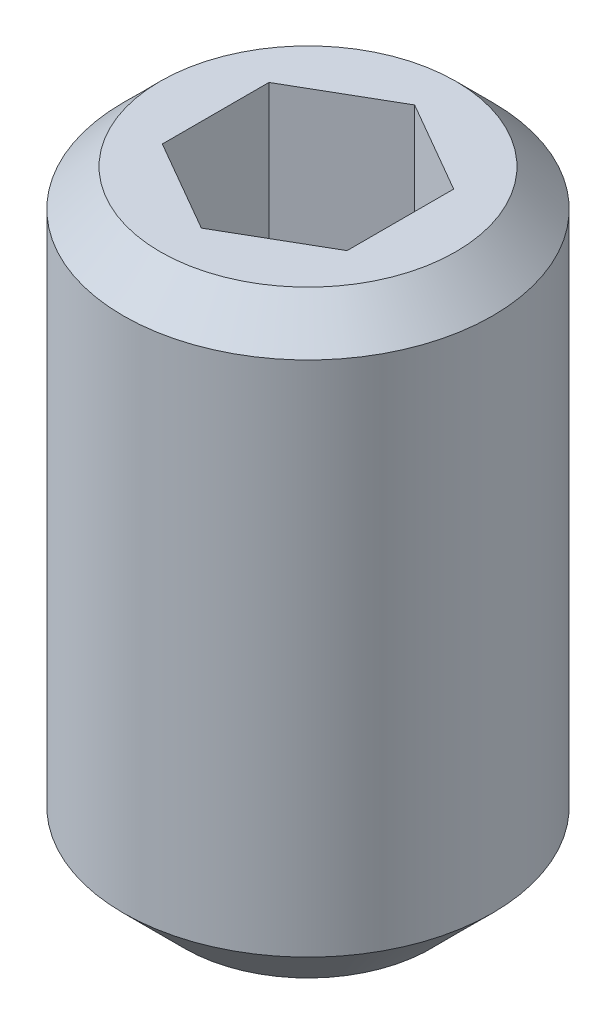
ISO-10303-21;
HEADER;
FILE_DESCRIPTION(('STEP AP214'),'2;1');
FILE_NAME('part.step','',(''),(''),'','','');
FILE_SCHEMA(('AUTOMOTIVE_DESIGN { 1 0 10303 214 1 1 1 1 }'));
ENDSEC;
DATA;
#1=APPLICATION_CONTEXT('core data for automotive mechanical design processes');
#2=APPLICATION_PROTOCOL_DEFINITION('international standard','automotive_design',2000,#1);
#3=PRODUCT_CONTEXT('',#1,'mechanical');
#4=PRODUCT('Part','Part','',(#3));
#5=PRODUCT_RELATED_PRODUCT_CATEGORY('part','',(#4));
#6=PRODUCT_DEFINITION_FORMATION('','',#4);
#7=PRODUCT_DEFINITION_CONTEXT('part definition',#1,'design');
#8=PRODUCT_DEFINITION('design','',#6,#7);
#9=PRODUCT_DEFINITION_SHAPE('','',#8);
#10=(LENGTH_UNIT() NAMED_UNIT(*) SI_UNIT(.MILLI.,.METRE.));
#11=(NAMED_UNIT(*) PLANE_ANGLE_UNIT() SI_UNIT($,.RADIAN.));
#12=(NAMED_UNIT(*) SI_UNIT($,.STERADIAN.) SOLID_ANGLE_UNIT());
#13=UNCERTAINTY_MEASURE_WITH_UNIT(LENGTH_MEASURE(1.E-05),#10,'distance_accuracy_value','');
#14=(GEOMETRIC_REPRESENTATION_CONTEXT(3) GLOBAL_UNCERTAINTY_ASSIGNED_CONTEXT((#13)) GLOBAL_UNIT_ASSIGNED_CONTEXT((#10,
#11,#12)) REPRESENTATION_CONTEXT('',''));
#15=CARTESIAN_POINT('',(0.,0.,0.));
#16=DIRECTION('',(0.,0.,1.));
#17=DIRECTION('',(1.,0.,0.));
#18=AXIS2_PLACEMENT_3D('',#15,#16,#17);
#19=CARTESIAN_POINT('',(0.,-0.599999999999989,0.));
#20=DIRECTION('',(0.,-1.,0.));
#21=DIRECTION('',(0.,0.,-1.));
#22=AXIS2_PLACEMENT_3D('',#19,#20,#21);
#23=CONICAL_SURFACE('',#22,3.,0.785398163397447);
#24=CARTESIAN_POINT('',(0.,0.,0.));
#25=DIRECTION('',(0.,-1.,0.));
#26=DIRECTION('',(0.,0.,-1.));
#27=AXIS2_PLACEMENT_3D('',#24,#25,#26);
#28=CIRCLE('',#27,2.4);
#29=CARTESIAN_POINT('',(0.,0.,-2.40000000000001));
#30=VERTEX_POINT('',#29);
#31=EDGE_CURVE('E11',#30,#30,#28,.T.);
#32=ORIENTED_EDGE('',*,*,#31,.T.);
#33=EDGE_LOOP('',(#32));
#34=FACE_BOUND('',#33,.T.);
#35=CARTESIAN_POINT('',(0.,-0.599999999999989,0.));
#36=DIRECTION('',(0.,-1.,0.));
#37=DIRECTION('',(0.,0.,-1.));
#38=AXIS2_PLACEMENT_3D('',#35,#36,#37);
#39=CIRCLE('',#38,3.);
#40=CARTESIAN_POINT('',(0.,-0.599999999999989,-3.00000000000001));
#41=VERTEX_POINT('',#40);
#42=EDGE_CURVE('E162',#41,#41,#39,.T.);
#43=ORIENTED_EDGE('',*,*,#42,.F.);
#44=EDGE_LOOP('',(#43));
#45=FACE_BOUND('',#44,.T.);
#46=ADVANCED_FACE('F34',(#34,#45),#23,.T.);
#47=CARTESIAN_POINT('',(1.50000000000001,0.,0.));
#48=DIRECTION('',(0.,1.,0.));
#49=DIRECTION('',(0.,0.,1.));
#50=AXIS2_PLACEMENT_3D('',#47,#48,#49);
#51=PLANE('',#50);
#52=DIRECTION('',(-0.866025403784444,0.,0.5));
#53=VECTOR('',#52,1.);
#54=CARTESIAN_POINT('',(-1.50000000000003,0.,-0.866025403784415));
#55=LINE('',#54,#53);
#56=CARTESIAN_POINT('',(0.,0.,-1.73205080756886));
#57=VERTEX_POINT('',#56);
#58=CARTESIAN_POINT('',(-1.50000000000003,0.,-0.866025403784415));
#59=VERTEX_POINT('',#58);
#60=EDGE_CURVE('E155',#57,#59,#55,.T.);
#61=ORIENTED_EDGE('',*,*,#60,.F.);
#62=DIRECTION('',(-0.866025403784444,0.,-0.5));
#63=VECTOR('',#62,1.);
#64=CARTESIAN_POINT('',(1.50000000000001,0.,-0.866025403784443));
#65=LINE('',#64,#63);
#66=CARTESIAN_POINT('',(1.50000000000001,0.,-0.866025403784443));
#67=VERTEX_POINT('',#66);
#68=EDGE_CURVE('E152',#67,#57,#65,.T.);
#69=ORIENTED_EDGE('',*,*,#68,.F.);
#70=DIRECTION('',(0.,0.,-1.));
#71=VECTOR('',#70,1.);
#72=CARTESIAN_POINT('',(1.50000000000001,0.,-0.866025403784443));
#73=LINE('',#72,#71);
#74=CARTESIAN_POINT('',(1.50000000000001,0.,0.866025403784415));
#75=VERTEX_POINT('',#74);
#76=EDGE_CURVE('E150',#75,#67,#73,.T.);
#77=ORIENTED_EDGE('',*,*,#76,.F.);
#78=DIRECTION('',(0.866025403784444,0.,-0.5));
#79=VECTOR('',#78,1.);
#80=CARTESIAN_POINT('',(1.50000000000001,0.,0.866025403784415));
#81=LINE('',#80,#79);
#82=CARTESIAN_POINT('',(0.,0.,1.73205080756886));
#83=VERTEX_POINT('',#82);
#84=EDGE_CURVE('E148',#83,#75,#81,.T.);
#85=ORIENTED_EDGE('',*,*,#84,.F.);
#86=DIRECTION('',(0.866025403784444,0.,0.5));
#87=VECTOR('',#86,1.);
#88=CARTESIAN_POINT('',(-1.50000000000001,0.,0.866025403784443));
#89=LINE('',#88,#87);
#90=CARTESIAN_POINT('',(-1.50000000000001,0.,0.866025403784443));
#91=VERTEX_POINT('',#90);
#92=EDGE_CURVE('E122',#91,#83,#89,.T.);
#93=ORIENTED_EDGE('',*,*,#92,.F.);
#94=DIRECTION('',(0.,0.,1.));
#95=VECTOR('',#94,1.);
#96=CARTESIAN_POINT('',(-1.50000000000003,0.,-0.866025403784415));
#97=LINE('',#96,#95);
#98=EDGE_CURVE('E115',#59,#91,#97,.T.);
#99=ORIENTED_EDGE('',*,*,#98,.F.);
#100=EDGE_LOOP('',(#61,#69,#77,#85,#93,#99));
#101=FACE_BOUND('',#100,.T.);
#102=ORIENTED_EDGE('',*,*,#31,.F.);
#103=EDGE_LOOP('',(#102));
#104=FACE_BOUND('',#103,.T.);
#105=ADVANCED_FACE('F229',(#101,#104),#51,.T.);
#106=CARTESIAN_POINT('',(0.,-10.,0.));
#107=DIRECTION('',(0.,-1.,0.));
#108=DIRECTION('',(0.,0.,-1.));
#109=AXIS2_PLACEMENT_3D('',#106,#107,#108);
#110=PLANE('',#109);
#111=CARTESIAN_POINT('',(0.,-10.,0.));
#112=DIRECTION('',(0.,-1.,0.));
#113=DIRECTION('',(0.,0.,-1.));
#114=AXIS2_PLACEMENT_3D('',#111,#112,#113);
#115=CIRCLE('',#114,2.);
#116=CARTESIAN_POINT('',(0.,-10.,-2.00000000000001));
#117=VERTEX_POINT('',#116);
#118=EDGE_CURVE('E179',#117,#117,#115,.T.);
#119=ORIENTED_EDGE('',*,*,#118,.T.);
#120=EDGE_LOOP('',(#119));
#121=FACE_BOUND('',#120,.T.);
#122=ADVANCED_FACE('F234',(#121),#110,.T.);
#123=CARTESIAN_POINT('',(0.,-10.,0.));
#124=DIRECTION('',(0.,1.,0.));
#125=DIRECTION('',(0.,0.,1.));
#126=AXIS2_PLACEMENT_3D('',#123,#124,#125);
#127=CONICAL_SURFACE('',#126,2.,0.785398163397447);
#128=CARTESIAN_POINT('',(0.,-9.00000000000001,0.));
#129=DIRECTION('',(0.,-1.,0.));
#130=DIRECTION('',(0.,0.,-1.));
#131=AXIS2_PLACEMENT_3D('',#128,#129,#130);
#132=CIRCLE('',#131,3.);
#133=CARTESIAN_POINT('',(0.,-9.00000000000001,-3.00000000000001));
#134=VERTEX_POINT('',#133);
#135=EDGE_CURVE('E176',#134,#134,#132,.T.);
#136=ORIENTED_EDGE('',*,*,#135,.T.);
#137=EDGE_LOOP('',(#136));
#138=FACE_BOUND('',#137,.T.);
#139=ORIENTED_EDGE('',*,*,#118,.F.);
#140=EDGE_LOOP('',(#139));
#141=FACE_BOUND('',#140,.T.);
#142=ADVANCED_FACE('F243',(#138,#141),#127,.T.);
#143=CARTESIAN_POINT('',(0.,-10.,0.));
#144=DIRECTION('',(0.,-1.,0.));
#145=DIRECTION('',(0.,0.,-1.));
#146=AXIS2_PLACEMENT_3D('',#143,#144,#145);
#147=CYLINDRICAL_SURFACE('',#146,3.);
#148=ORIENTED_EDGE('',*,*,#42,.T.);
#149=EDGE_LOOP('',(#148));
#150=FACE_BOUND('',#149,.T.);
#151=ORIENTED_EDGE('',*,*,#135,.F.);
#152=EDGE_LOOP('',(#151));
#153=FACE_BOUND('',#152,.T.);
#154=ADVANCED_FACE('F240',(#150,#153),#147,.T.);
#155=CARTESIAN_POINT('',(-1.50000000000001,-3.,0.866025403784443));
#156=DIRECTION('',(-0.499999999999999,0.,0.866025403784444));
#157=DIRECTION('',(0.866025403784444,0.,0.5));
#158=AXIS2_PLACEMENT_3D('',#155,#156,#157);
#159=PLANE('',#158);
#160=ORIENTED_EDGE('',*,*,#92,.T.);
#161=DIRECTION('',(0.,1.,0.));
#162=VECTOR('',#161,1.);
#163=CARTESIAN_POINT('',(0.,-3.,1.73205080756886));
#164=LINE('',#163,#162);
#165=CARTESIAN_POINT('',(0.,-3.,1.73205080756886));
#166=VERTEX_POINT('',#165);
#167=EDGE_CURVE('E119',#166,#83,#164,.T.);
#168=ORIENTED_EDGE('',*,*,#167,.F.);
#169=DIRECTION('',(0.866025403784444,0.,0.5));
#170=VECTOR('',#169,1.);
#171=CARTESIAN_POINT('',(-1.50000000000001,-3.,0.866025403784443));
#172=LINE('',#171,#170);
#173=CARTESIAN_POINT('',(-0.750000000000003,-3.,1.29903810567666));
#174=VERTEX_POINT('',#173);
#175=EDGE_CURVE('E104',#174,#166,#172,.T.);
#176=ORIENTED_EDGE('',*,*,#175,.F.);
#177=CARTESIAN_POINT('',(-1.50000000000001,-3.,0.866025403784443));
#178=VERTEX_POINT('',#177);
#179=EDGE_CURVE('E114',#178,#174,#172,.T.);
#180=ORIENTED_EDGE('',*,*,#179,.F.);
#181=DIRECTION('',(0.,1.,0.));
#182=VECTOR('',#181,1.);
#183=CARTESIAN_POINT('',(-1.50000000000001,-3.,0.866025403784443));
#184=LINE('',#183,#182);
#185=EDGE_CURVE('E160',#178,#91,#184,.T.);
#186=ORIENTED_EDGE('',*,*,#185,.T.);
#187=EDGE_LOOP('',(#160,#168,#176,#180,#186));
#188=FACE_BOUND('',#187,.T.);
#189=ADVANCED_FACE('F120',(#188),#159,.F.);
#190=CARTESIAN_POINT('',(-1.50000000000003,-3.,-0.866025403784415));
#191=DIRECTION('',(-1.,0.,0.));
#192=DIRECTION('',(0.,0.,1.));
#193=AXIS2_PLACEMENT_3D('',#190,#191,#192);
#194=PLANE('',#193);
#195=ORIENTED_EDGE('',*,*,#98,.T.);
#196=ORIENTED_EDGE('',*,*,#185,.F.);
#197=DIRECTION('',(0.,0.,1.));
#198=VECTOR('',#197,1.);
#199=CARTESIAN_POINT('',(-1.50000000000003,-3.,-0.866025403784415));
#200=LINE('',#199,#198);
#201=CARTESIAN_POINT('',(-1.50000000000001,-3.,0.));
#202=VERTEX_POINT('',#201);
#203=EDGE_CURVE('E144',#202,#178,#200,.T.);
#204=ORIENTED_EDGE('',*,*,#203,.F.);
#205=CARTESIAN_POINT('',(-1.50000000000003,-3.,-0.866025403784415));
#206=VERTEX_POINT('',#205);
#207=EDGE_CURVE('E126',#206,#202,#200,.T.);
#208=ORIENTED_EDGE('',*,*,#207,.F.);
#209=DIRECTION('',(0.,1.,0.));
#210=VECTOR('',#209,1.);
#211=CARTESIAN_POINT('',(-1.50000000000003,-3.,-0.866025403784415));
#212=LINE('',#211,#210);
#213=EDGE_CURVE('E163',#206,#59,#212,.T.);
#214=ORIENTED_EDGE('',*,*,#213,.T.);
#215=EDGE_LOOP('',(#195,#196,#204,#208,#214));
#216=FACE_BOUND('',#215,.T.);
#217=ADVANCED_FACE('F201',(#216),#194,.F.);
#218=CARTESIAN_POINT('',(-1.50000000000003,-3.,-0.866025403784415));
#219=DIRECTION('',(-0.499999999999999,0.,-0.866025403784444));
#220=DIRECTION('',(-0.866025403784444,0.,0.5));
#221=AXIS2_PLACEMENT_3D('',#218,#219,#220);
#222=PLANE('',#221);
#223=ORIENTED_EDGE('',*,*,#60,.T.);
#224=ORIENTED_EDGE('',*,*,#213,.F.);
#225=DIRECTION('',(-0.866025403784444,0.,0.5));
#226=VECTOR('',#225,1.);
#227=CARTESIAN_POINT('',(-1.50000000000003,-3.,-0.866025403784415));
#228=LINE('',#227,#226);
#229=CARTESIAN_POINT('',(-0.750000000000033,-3.,-1.29903810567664));
#230=VERTEX_POINT('',#229);
#231=EDGE_CURVE('E142',#230,#206,#228,.T.);
#232=ORIENTED_EDGE('',*,*,#231,.F.);
#233=CARTESIAN_POINT('',(0.,-3.,-1.73205080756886));
#234=VERTEX_POINT('',#233);
#235=EDGE_CURVE('E48',#234,#230,#228,.T.);
#236=ORIENTED_EDGE('',*,*,#235,.F.);
#237=DIRECTION('',(0.,1.,0.));
#238=VECTOR('',#237,1.);
#239=CARTESIAN_POINT('',(0.,-3.,-1.73205080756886));
#240=LINE('',#239,#238);
#241=EDGE_CURVE('E166',#234,#57,#240,.T.);
#242=ORIENTED_EDGE('',*,*,#241,.T.);
#243=EDGE_LOOP('',(#223,#224,#232,#236,#242));
#244=FACE_BOUND('',#243,.T.);
#245=ADVANCED_FACE('F265',(#244),#222,.F.);
#246=CARTESIAN_POINT('',(1.50000000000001,-3.,-0.866025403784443));
#247=DIRECTION('',(0.499999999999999,0.,-0.866025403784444));
#248=DIRECTION('',(-0.866025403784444,0.,-0.5));
#249=AXIS2_PLACEMENT_3D('',#246,#247,#248);
#250=PLANE('',#249);
#251=ORIENTED_EDGE('',*,*,#68,.T.);
#252=ORIENTED_EDGE('',*,*,#241,.F.);
#253=DIRECTION('',(-0.866025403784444,0.,-0.5));
#254=VECTOR('',#253,1.);
#255=CARTESIAN_POINT('',(1.50000000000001,-3.,-0.866025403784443));
#256=LINE('',#255,#254);
#257=CARTESIAN_POINT('',(0.75,-3.,-1.29903810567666));
#258=VERTEX_POINT('',#257);
#259=EDGE_CURVE('E138',#258,#234,#256,.T.);
#260=ORIENTED_EDGE('',*,*,#259,.F.);
#261=CARTESIAN_POINT('',(1.50000000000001,-3.,-0.866025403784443));
#262=VERTEX_POINT('',#261);
#263=EDGE_CURVE('E139',#262,#258,#256,.T.);
#264=ORIENTED_EDGE('',*,*,#263,.F.);
#265=DIRECTION('',(0.,1.,0.));
#266=VECTOR('',#265,1.);
#267=CARTESIAN_POINT('',(1.50000000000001,-3.,-0.866025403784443));
#268=LINE('',#267,#266);
#269=EDGE_CURVE('E169',#262,#67,#268,.T.);
#270=ORIENTED_EDGE('',*,*,#269,.T.);
#271=EDGE_LOOP('',(#251,#252,#260,#264,#270));
#272=FACE_BOUND('',#271,.T.);
#273=ADVANCED_FACE('F215',(#272),#250,.F.);
#274=CARTESIAN_POINT('',(1.50000000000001,-3.,-0.866025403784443));
#275=DIRECTION('',(1.,0.,0.));
#276=DIRECTION('',(0.,0.,-1.));
#277=AXIS2_PLACEMENT_3D('',#274,#275,#276);
#278=PLANE('',#277);
#279=ORIENTED_EDGE('',*,*,#76,.T.);
#280=ORIENTED_EDGE('',*,*,#269,.F.);
#281=DIRECTION('',(0.,0.,-1.));
#282=VECTOR('',#281,1.);
#283=CARTESIAN_POINT('',(1.50000000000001,-3.,-0.866025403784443));
#284=LINE('',#283,#282);
#285=CARTESIAN_POINT('',(1.50000000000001,-3.,0.));
#286=VERTEX_POINT('',#285);
#287=EDGE_CURVE('E132',#286,#262,#284,.T.);
#288=ORIENTED_EDGE('',*,*,#287,.F.);
#289=CARTESIAN_POINT('',(1.50000000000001,-3.,0.866025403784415));
#290=VERTEX_POINT('',#289);
#291=EDGE_CURVE('E134',#290,#286,#284,.T.);
#292=ORIENTED_EDGE('',*,*,#291,.F.);
#293=DIRECTION('',(0.,1.,0.));
#294=VECTOR('',#293,1.);
#295=CARTESIAN_POINT('',(1.50000000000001,-3.,0.866025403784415));
#296=LINE('',#295,#294);
#297=EDGE_CURVE('E125',#290,#75,#296,.T.);
#298=ORIENTED_EDGE('',*,*,#297,.T.);
#299=EDGE_LOOP('',(#279,#280,#288,#292,#298));
#300=FACE_BOUND('',#299,.T.);
#301=ADVANCED_FACE('F210',(#300),#278,.F.);
#302=CARTESIAN_POINT('',(1.50000000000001,-3.,0.866025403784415));
#303=DIRECTION('',(0.499999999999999,0.,0.866025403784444));
#304=DIRECTION('',(0.866025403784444,0.,-0.5));
#305=AXIS2_PLACEMENT_3D('',#302,#303,#304);
#306=PLANE('',#305);
#307=ORIENTED_EDGE('',*,*,#84,.T.);
#308=ORIENTED_EDGE('',*,*,#297,.F.);
#309=DIRECTION('',(0.866025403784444,0.,-0.5));
#310=VECTOR('',#309,1.);
#311=CARTESIAN_POINT('',(1.50000000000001,-3.,0.866025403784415));
#312=LINE('',#311,#310);
#313=CARTESIAN_POINT('',(0.750000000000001,-3.,1.29903810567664));
#314=VERTEX_POINT('',#313);
#315=EDGE_CURVE('E131',#314,#290,#312,.T.);
#316=ORIENTED_EDGE('',*,*,#315,.F.);
#317=EDGE_CURVE('E108',#166,#314,#312,.T.);
#318=ORIENTED_EDGE('',*,*,#317,.F.);
#319=ORIENTED_EDGE('',*,*,#167,.T.);
#320=EDGE_LOOP('',(#307,#308,#316,#318,#319));
#321=FACE_BOUND('',#320,.T.);
#322=ADVANCED_FACE('F129',(#321),#306,.F.);
#323=CARTESIAN_POINT('',(1.50000000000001,-3.,2.59807621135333));
#324=DIRECTION('',(0.,-1.,0.));
#325=DIRECTION('',(0.,0.,-1.));
#326=AXIS2_PLACEMENT_3D('',#323,#324,#325);
#327=PLANE('',#326);
#328=CARTESIAN_POINT('',(0.,-3.,0.));
#329=DIRECTION('',(0.,-1.,0.));
#330=DIRECTION('',(0.,0.,-1.));
#331=AXIS2_PLACEMENT_3D('',#328,#329,#330);
#332=CIRCLE('',#331,1.5);
#333=EDGE_CURVE('E41',#258,#286,#332,.T.);
#334=ORIENTED_EDGE('',*,*,#333,.T.);
#335=ORIENTED_EDGE('',*,*,#287,.T.);
#336=ORIENTED_EDGE('',*,*,#263,.T.);
#337=EDGE_LOOP('',(#334,#335,#336));
#338=FACE_BOUND('',#337,.T.);
#339=ADVANCED_FACE('F213',(#338),#327,.F.);
#340=EDGE_CURVE('E182',#286,#314,#332,.T.);
#341=ORIENTED_EDGE('',*,*,#340,.T.);
#342=ORIENTED_EDGE('',*,*,#315,.T.);
#343=ORIENTED_EDGE('',*,*,#291,.T.);
#344=EDGE_LOOP('',(#341,#342,#343));
#345=FACE_BOUND('',#344,.T.);
#346=ADVANCED_FACE('F207',(#345),#327,.F.);
#347=EDGE_CURVE('E110',#314,#174,#332,.T.);
#348=ORIENTED_EDGE('',*,*,#347,.T.);
#349=ORIENTED_EDGE('',*,*,#175,.T.);
#350=ORIENTED_EDGE('',*,*,#317,.T.);
#351=EDGE_LOOP('',(#348,#349,#350));
#352=FACE_BOUND('',#351,.T.);
#353=ADVANCED_FACE('F106',(#352),#327,.F.);
#354=EDGE_CURVE('E190',#174,#202,#332,.T.);
#355=ORIENTED_EDGE('',*,*,#354,.T.);
#356=ORIENTED_EDGE('',*,*,#203,.T.);
#357=ORIENTED_EDGE('',*,*,#179,.T.);
#358=EDGE_LOOP('',(#355,#356,#357));
#359=FACE_BOUND('',#358,.T.);
#360=ADVANCED_FACE('F196',(#359),#327,.F.);
#361=EDGE_CURVE('E186',#202,#230,#332,.T.);
#362=ORIENTED_EDGE('',*,*,#361,.T.);
#363=ORIENTED_EDGE('',*,*,#231,.T.);
#364=ORIENTED_EDGE('',*,*,#207,.T.);
#365=EDGE_LOOP('',(#362,#363,#364));
#366=FACE_BOUND('',#365,.T.);
#367=ADVANCED_FACE('F202',(#366),#327,.F.);
#368=EDGE_CURVE('E181',#230,#258,#332,.T.);
#369=ORIENTED_EDGE('',*,*,#368,.T.);
#370=ORIENTED_EDGE('',*,*,#259,.T.);
#371=ORIENTED_EDGE('',*,*,#235,.T.);
#372=EDGE_LOOP('',(#369,#370,#371));
#373=FACE_BOUND('',#372,.T.);
#374=ADVANCED_FACE('F218',(#373),#327,.F.);
#375=CARTESIAN_POINT('',(0.,-3.,0.));
#376=DIRECTION('',(0.,1.,0.));
#377=DIRECTION('',(0.,0.,1.));
#378=AXIS2_PLACEMENT_3D('',#375,#376,#377);
#379=CONICAL_SURFACE('',#378,1.5,1.0471975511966);
#380=CARTESIAN_POINT('',(0.,-3.86602540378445,0.));
#381=VERTEX_POINT('',#380);
#382=VERTEX_LOOP('',#381);
#383=FACE_BOUND('',#382,.T.);
#384=ORIENTED_EDGE('',*,*,#333,.F.);
#385=ORIENTED_EDGE('',*,*,#368,.F.);
#386=ORIENTED_EDGE('',*,*,#361,.F.);
#387=ORIENTED_EDGE('',*,*,#354,.F.);
#388=ORIENTED_EDGE('',*,*,#347,.F.);
#389=ORIENTED_EDGE('',*,*,#340,.F.);
#390=EDGE_LOOP('',(#384,#385,#386,#387,#388,#389));
#391=FACE_BOUND('',#390,.T.);
#392=ADVANCED_FACE('F204',(#383,#391),#379,.F.);
#393=CLOSED_SHELL('',(#46,#105,#122,#142,#154,#189,#217,#245,#273,#301,#322,#339,#346,#353,#360,
#367,#374,#392));
#394=MANIFOLD_SOLID_BREP('B2',#393);
#395=ADVANCED_BREP_SHAPE_REPRESENTATION('',(#18,#394),#14);
#396=SHAPE_DEFINITION_REPRESENTATION(#9,#395);
ENDSEC;
END-ISO-10303-21;
